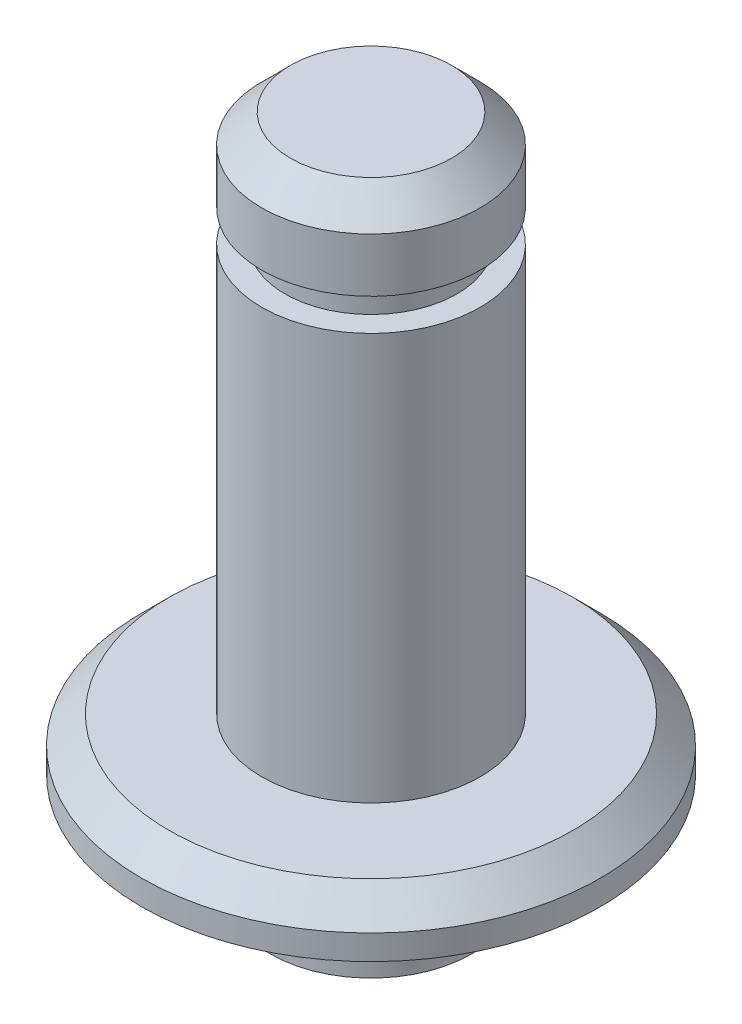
from build123d import *

# Parameters (mm, degrees)
CHAMFER1_SIZE = 0.79375
CHAMFER2_SIZE = 0.762
SKETCH3_W     = 0.64135
SKETCH3_H     = 0.889


with BuildPart() as part:
    # Sketch2 → Revolve1 (revolve)
    with BuildSketch(Plane(origin=(0, 0, 0), x_dir=(0, 0, -1), z_dir=(1, 0, 0))):
        Polygon((2.778125, 0), (6.35, 0), (6.35, 1.4478), (3.0226, 1.4478), (3.0226, 15.875), (0, 15.875), (0, -2.921), (2.778125, -2.921), align=None)
    revolve(axis=Axis((0, 0, 0), (0, 1, 0)))

    # Chamfer1
    chamfer1_edges = [part.edges().sort_by_distance(p)[0] for p in [
        (0, 15.875, 3.0226),
    ]]
    chamfer(chamfer1_edges, length=CHAMFER1_SIZE)

    # Chamfer2
    chamfer2_edges = [part.edges().sort_by_distance(p)[0] for p in [
        (0, 1.4478, 6.35),
    ]]
    chamfer(chamfer2_edges, length=CHAMFER2_SIZE)

    # Sketch3 → Cut-Revolve1 (revolve, cut)
    with BuildSketch(Plane(origin=(0, 0, 0), x_dir=(0, 0, -1), z_dir=(1, 0, 0))):
        with Locations((2.701925, 13.1445)):
            Rectangle(SKETCH3_W, SKETCH3_H)
    revolve(axis=Axis((0, 0, 0), (0, 1, 0)), mode=Mode.SUBTRACT)


solid = part.part
